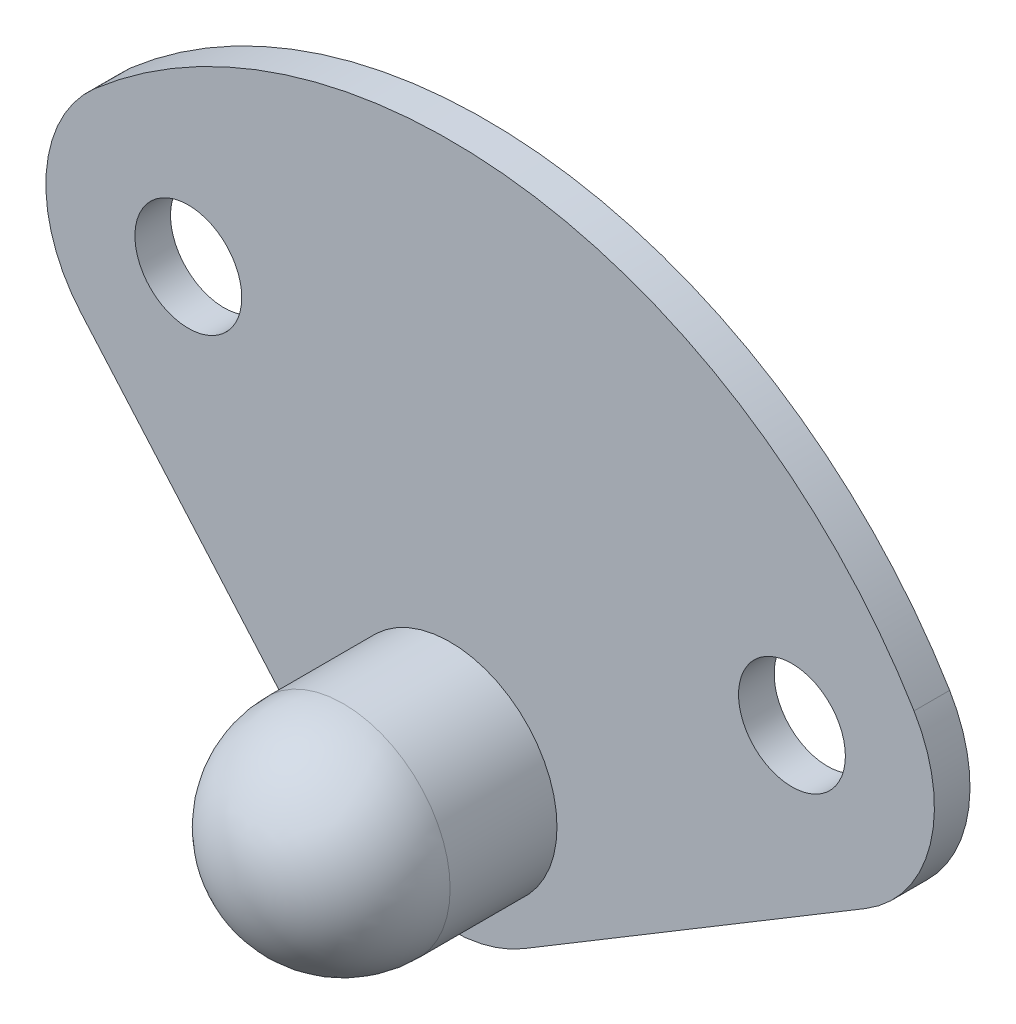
ISO-10303-21;
HEADER;
FILE_DESCRIPTION(('STEP AP214'),'2;1');
FILE_NAME('part.step','',(''),(''),'','','');
FILE_SCHEMA(('AUTOMOTIVE_DESIGN { 1 0 10303 214 1 1 1 1 }'));
ENDSEC;
DATA;
#1=APPLICATION_CONTEXT('core data for automotive mechanical design processes');
#2=APPLICATION_PROTOCOL_DEFINITION('international standard','automotive_design',2000,#1);
#3=PRODUCT_CONTEXT('',#1,'mechanical');
#4=PRODUCT('Part','Part','',(#3));
#5=PRODUCT_RELATED_PRODUCT_CATEGORY('part','',(#4));
#6=PRODUCT_DEFINITION_FORMATION('','',#4);
#7=PRODUCT_DEFINITION_CONTEXT('part definition',#1,'design');
#8=PRODUCT_DEFINITION('design','',#6,#7);
#9=PRODUCT_DEFINITION_SHAPE('','',#8);
#10=(LENGTH_UNIT() NAMED_UNIT(*) SI_UNIT(.MILLI.,.METRE.));
#11=(NAMED_UNIT(*) PLANE_ANGLE_UNIT() SI_UNIT($,.RADIAN.));
#12=(NAMED_UNIT(*) SI_UNIT($,.STERADIAN.) SOLID_ANGLE_UNIT());
#13=UNCERTAINTY_MEASURE_WITH_UNIT(LENGTH_MEASURE(1.E-05),#10,'distance_accuracy_value','');
#14=(GEOMETRIC_REPRESENTATION_CONTEXT(3) GLOBAL_UNCERTAINTY_ASSIGNED_CONTEXT((#13)) GLOBAL_UNIT_ASSIGNED_CONTEXT((#10,
#11,#12)) REPRESENTATION_CONTEXT('',''));
#15=CARTESIAN_POINT('',(0.,0.,0.));
#16=DIRECTION('',(0.,0.,1.));
#17=DIRECTION('',(1.,0.,0.));
#18=AXIS2_PLACEMENT_3D('',#15,#16,#17);
#19=CARTESIAN_POINT('',(0.,0.,9.99999999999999));
#20=DIRECTION('',(0.,0.,-1.));
#21=DIRECTION('',(-1.,0.,0.));
#22=AXIS2_PLACEMENT_3D('',#19,#20,#21);
#23=PLANE('',#22);
#24=CARTESIAN_POINT('',(95.9763559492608,57.7281482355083,10.));
#25=DIRECTION('',(0.,0.,1.));
#26=DIRECTION('',(1.,0.,0.));
#27=AXIS2_PLACEMENT_3D('',#24,#25,#26);
#28=CIRCLE('',#27,15.);
#29=CARTESIAN_POINT('',(110.976355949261,57.7281482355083,10.));
#30=VERTEX_POINT('',#29);
#31=EDGE_CURVE('E218',#30,#30,#28,.T.);
#32=ORIENTED_EDGE('',*,*,#31,.F.);
#33=EDGE_LOOP('',(#32));
#34=FACE_BOUND('',#33,.T.);
#35=CARTESIAN_POINT('',(0.,0.,9.99999999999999));
#36=DIRECTION('',(0.,0.,1.));
#37=DIRECTION('',(-1.,0.,0.));
#38=AXIS2_PLACEMENT_3D('',#35,#36,#37);
#39=CIRCLE('',#38,40.);
#40=CARTESIAN_POINT('',(-30.1763827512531,-26.2561597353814,9.99999999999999));
#41=VERTEX_POINT('',#40);
#42=CARTESIAN_POINT('',(20.6171957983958,-34.2772699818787,9.99999999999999));
#43=VERTEX_POINT('',#42);
#44=EDGE_CURVE('E132',#41,#43,#39,.T.);
#45=ORIENTED_EDGE('',*,*,#44,.T.);
#46=DIRECTION('',(0.85693174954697,0.515429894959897,0.));
#47=VECTOR('',#46,1.);
#48=CARTESIAN_POINT('',(116.593551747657,23.4508782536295,9.99999999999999));
#49=LINE('',#48,#47);
#50=CARTESIAN_POINT('',(116.593551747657,23.4508782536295,9.99999999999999));
#51=VERTEX_POINT('',#50);
#52=EDGE_CURVE('E90',#43,#51,#49,.T.);
#53=ORIENTED_EDGE('',*,*,#52,.T.);
#54=CARTESIAN_POINT('',(95.9763559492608,57.7281482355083,10.));
#55=DIRECTION('',(0.,0.,1.));
#56=DIRECTION('',(-1.,0.,0.));
#57=AXIS2_PLACEMENT_3D('',#54,#55,#56);
#58=CIRCLE('',#57,39.9999999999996);
#59=CARTESIAN_POINT('',(130.253625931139,78.3453440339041,9.99999999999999));
#60=VERTEX_POINT('',#59);
#61=EDGE_CURVE('E103',#51,#60,#58,.T.);
#62=ORIENTED_EDGE('',*,*,#61,.T.);
#63=CARTESIAN_POINT('',(0.,0.,9.99999999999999));
#64=DIRECTION('',(0.,0.,1.));
#65=DIRECTION('',(1.,0.,0.));
#66=AXIS2_PLACEMENT_3D('',#63,#64,#65);
#67=CIRCLE('',#66,152.);
#68=CARTESIAN_POINT('',(-99.7734069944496,114.670254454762,10.));
#69=VERTEX_POINT('',#68);
#70=EDGE_CURVE('E97',#60,#69,#67,.T.);
#71=ORIENTED_EDGE('',*,*,#70,.T.);
#72=CARTESIAN_POINT('',(-73.5172472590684,84.4938717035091,9.99999999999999));
#73=DIRECTION('',(0.,0.,1.));
#74=DIRECTION('',(-1.,0.,0.));
#75=AXIS2_PLACEMENT_3D('',#72,#73,#74);
#76=CIRCLE('',#75,40.);
#77=CARTESIAN_POINT('',(-103.693630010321,58.2377119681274,9.99999999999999));
#78=VERTEX_POINT('',#77);
#79=EDGE_CURVE('E101',#69,#78,#76,.T.);
#80=ORIENTED_EDGE('',*,*,#79,.T.);
#81=DIRECTION('',(0.656403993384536,-0.754409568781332,0.));
#82=VECTOR('',#81,1.);
#83=CARTESIAN_POINT('',(-30.1763827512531,-26.2561597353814,9.99999999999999));
#84=LINE('',#83,#82);
#85=EDGE_CURVE('E53',#78,#41,#84,.T.);
#86=ORIENTED_EDGE('',*,*,#85,.T.);
#87=EDGE_LOOP('',(#45,#53,#62,#71,#80,#86));
#88=FACE_BOUND('',#87,.T.);
#89=CARTESIAN_POINT('',(0.,0.,9.99999999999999));
#90=DIRECTION('',(0.,0.,1.));
#91=DIRECTION('',(1.,0.,0.));
#92=AXIS2_PLACEMENT_3D('',#89,#90,#91);
#93=CIRCLE('',#92,30.);
#94=CARTESIAN_POINT('',(30.,0.,9.99999999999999));
#95=VERTEX_POINT('',#94);
#96=EDGE_CURVE('E125',#95,#95,#93,.T.);
#97=ORIENTED_EDGE('',*,*,#96,.F.);
#98=EDGE_LOOP('',(#97));
#99=FACE_BOUND('',#98,.T.);
#100=CARTESIAN_POINT('',(-73.5172472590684,84.4938717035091,9.99999999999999));
#101=DIRECTION('',(0.,0.,1.));
#102=DIRECTION('',(1.,0.,0.));
#103=AXIS2_PLACEMENT_3D('',#100,#101,#102);
#104=CIRCLE('',#103,15.);
#105=CARTESIAN_POINT('',(-58.5172472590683,84.4938717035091,9.99999999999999));
#106=VERTEX_POINT('',#105);
#107=EDGE_CURVE('E212',#106,#106,#104,.T.);
#108=ORIENTED_EDGE('',*,*,#107,.F.);
#109=EDGE_LOOP('',(#108));
#110=FACE_BOUND('',#109,.T.);
#111=ADVANCED_FACE('F36',(#34,#88,#99,#110),#23,.F.);
#112=CARTESIAN_POINT('',(0.,0.,0.));
#113=DIRECTION('',(0.,0.,-1.));
#114=DIRECTION('',(-1.,0.,0.));
#115=AXIS2_PLACEMENT_3D('',#112,#113,#114);
#116=PLANE('',#115);
#117=CARTESIAN_POINT('',(95.9763559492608,57.7281482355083,0.));
#118=DIRECTION('',(0.,0.,1.));
#119=DIRECTION('',(1.,0.,0.));
#120=AXIS2_PLACEMENT_3D('',#117,#118,#119);
#121=CIRCLE('',#120,15.);
#122=CARTESIAN_POINT('',(110.976355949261,57.7281482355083,0.));
#123=VERTEX_POINT('',#122);
#124=EDGE_CURVE('E215',#123,#123,#121,.T.);
#125=ORIENTED_EDGE('',*,*,#124,.T.);
#126=EDGE_LOOP('',(#125));
#127=FACE_BOUND('',#126,.T.);
#128=CARTESIAN_POINT('',(0.,0.,0.));
#129=DIRECTION('',(0.,0.,1.));
#130=DIRECTION('',(-1.,0.,0.));
#131=AXIS2_PLACEMENT_3D('',#128,#129,#130);
#132=CIRCLE('',#131,40.);
#133=CARTESIAN_POINT('',(-30.1763827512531,-26.2561597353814,0.));
#134=VERTEX_POINT('',#133);
#135=CARTESIAN_POINT('',(20.6171957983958,-34.2772699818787,0.));
#136=VERTEX_POINT('',#135);
#137=EDGE_CURVE('E121',#134,#136,#132,.T.);
#138=ORIENTED_EDGE('',*,*,#137,.F.);
#139=DIRECTION('',(0.656403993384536,-0.754409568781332,0.));
#140=VECTOR('',#139,1.);
#141=CARTESIAN_POINT('',(-30.1763827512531,-26.2561597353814,0.));
#142=LINE('',#141,#140);
#143=CARTESIAN_POINT('',(-103.693630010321,58.2377119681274,0.));
#144=VERTEX_POINT('',#143);
#145=EDGE_CURVE('E82',#144,#134,#142,.T.);
#146=ORIENTED_EDGE('',*,*,#145,.F.);
#147=CARTESIAN_POINT('',(-73.5172472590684,84.4938717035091,0.));
#148=DIRECTION('',(0.,0.,1.));
#149=DIRECTION('',(-1.,0.,0.));
#150=AXIS2_PLACEMENT_3D('',#147,#148,#149);
#151=CIRCLE('',#150,40.);
#152=CARTESIAN_POINT('',(-99.7734069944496,114.670254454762,0.));
#153=VERTEX_POINT('',#152);
#154=EDGE_CURVE('E76',#153,#144,#151,.T.);
#155=ORIENTED_EDGE('',*,*,#154,.F.);
#156=CARTESIAN_POINT('',(0.,0.,0.));
#157=DIRECTION('',(0.,0.,1.));
#158=DIRECTION('',(1.,0.,0.));
#159=AXIS2_PLACEMENT_3D('',#156,#157,#158);
#160=CIRCLE('',#159,152.);
#161=CARTESIAN_POINT('',(130.253625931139,78.3453440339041,0.));
#162=VERTEX_POINT('',#161);
#163=EDGE_CURVE('E111',#162,#153,#160,.T.);
#164=ORIENTED_EDGE('',*,*,#163,.F.);
#165=CARTESIAN_POINT('',(95.9763559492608,57.7281482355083,0.));
#166=DIRECTION('',(0.,0.,1.));
#167=DIRECTION('',(-1.,0.,0.));
#168=AXIS2_PLACEMENT_3D('',#165,#166,#167);
#169=CIRCLE('',#168,39.9999999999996);
#170=CARTESIAN_POINT('',(116.593551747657,23.4508782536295,0.));
#171=VERTEX_POINT('',#170);
#172=EDGE_CURVE('E127',#171,#162,#169,.T.);
#173=ORIENTED_EDGE('',*,*,#172,.F.);
#174=DIRECTION('',(0.85693174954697,0.515429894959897,0.));
#175=VECTOR('',#174,1.);
#176=CARTESIAN_POINT('',(116.593551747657,23.4508782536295,0.));
#177=LINE('',#176,#175);
#178=EDGE_CURVE('E124',#136,#171,#177,.T.);
#179=ORIENTED_EDGE('',*,*,#178,.F.);
#180=EDGE_LOOP('',(#138,#146,#155,#164,#173,#179));
#181=FACE_BOUND('',#180,.T.);
#182=CARTESIAN_POINT('',(0.,0.,0.));
#183=DIRECTION('',(0.,0.,-1.));
#184=DIRECTION('',(-1.,0.,0.));
#185=AXIS2_PLACEMENT_3D('',#182,#183,#184);
#186=CIRCLE('',#185,30.);
#187=CARTESIAN_POINT('',(-30.,0.,0.));
#188=VERTEX_POINT('',#187);
#189=EDGE_CURVE('E208',#188,#188,#186,.T.);
#190=ORIENTED_EDGE('',*,*,#189,.F.);
#191=EDGE_LOOP('',(#190));
#192=FACE_BOUND('',#191,.T.);
#193=CARTESIAN_POINT('',(-73.5172472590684,84.4938717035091,0.));
#194=DIRECTION('',(0.,0.,1.));
#195=DIRECTION('',(1.,0.,0.));
#196=AXIS2_PLACEMENT_3D('',#193,#194,#195);
#197=CIRCLE('',#196,15.);
#198=CARTESIAN_POINT('',(-58.5172472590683,84.4938717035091,0.));
#199=VERTEX_POINT('',#198);
#200=EDGE_CURVE('E211',#199,#199,#197,.T.);
#201=ORIENTED_EDGE('',*,*,#200,.T.);
#202=EDGE_LOOP('',(#201));
#203=FACE_BOUND('',#202,.T.);
#204=ADVANCED_FACE('F141',(#127,#181,#192,#203),#116,.T.);
#205=CARTESIAN_POINT('',(0.,0.,9.99999999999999));
#206=DIRECTION('',(0.,0.,-1.));
#207=DIRECTION('',(-1.,0.,0.));
#208=AXIS2_PLACEMENT_3D('',#205,#206,#207);
#209=CYLINDRICAL_SURFACE('',#208,40.);
#210=ORIENTED_EDGE('',*,*,#137,.T.);
#211=DIRECTION('',(0.,0.,-1.));
#212=VECTOR('',#211,1.);
#213=CARTESIAN_POINT('',(20.6171957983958,-34.2772699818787,9.99999999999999));
#214=LINE('',#213,#212);
#215=EDGE_CURVE('E11',#43,#136,#214,.T.);
#216=ORIENTED_EDGE('',*,*,#215,.F.);
#217=ORIENTED_EDGE('',*,*,#44,.F.);
#218=DIRECTION('',(0.,0.,-1.));
#219=VECTOR('',#218,1.);
#220=CARTESIAN_POINT('',(-30.1763827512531,-26.2561597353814,9.99999999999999));
#221=LINE('',#220,#219);
#222=EDGE_CURVE('E117',#41,#134,#221,.T.);
#223=ORIENTED_EDGE('',*,*,#222,.T.);
#224=EDGE_LOOP('',(#210,#216,#217,#223));
#225=FACE_BOUND('',#224,.T.);
#226=ADVANCED_FACE('F38',(#225),#209,.T.);
#227=CARTESIAN_POINT('',(116.593551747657,23.4508782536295,9.99999999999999));
#228=DIRECTION('',(-0.515429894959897,0.85693174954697,0.));
#229=DIRECTION('',(-0.85693174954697,-0.515429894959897,0.));
#230=AXIS2_PLACEMENT_3D('',#227,#228,#229);
#231=PLANE('',#230);
#232=ORIENTED_EDGE('',*,*,#178,.T.);
#233=DIRECTION('',(0.,0.,-1.));
#234=VECTOR('',#233,1.);
#235=CARTESIAN_POINT('',(116.593551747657,23.4508782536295,9.99999999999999));
#236=LINE('',#235,#234);
#237=EDGE_CURVE('E45',#51,#171,#236,.T.);
#238=ORIENTED_EDGE('',*,*,#237,.F.);
#239=ORIENTED_EDGE('',*,*,#52,.F.);
#240=ORIENTED_EDGE('',*,*,#215,.T.);
#241=EDGE_LOOP('',(#232,#238,#239,#240));
#242=FACE_BOUND('',#241,.T.);
#243=ADVANCED_FACE('F305',(#242),#231,.F.);
#244=CARTESIAN_POINT('',(95.9763559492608,57.7281482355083,10.));
#245=DIRECTION('',(0.,0.,-1.));
#246=DIRECTION('',(-1.,0.,0.));
#247=AXIS2_PLACEMENT_3D('',#244,#245,#246);
#248=CYLINDRICAL_SURFACE('',#247,39.9999999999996);
#249=ORIENTED_EDGE('',*,*,#172,.T.);
#250=DIRECTION('',(0.,0.,-1.));
#251=VECTOR('',#250,1.);
#252=CARTESIAN_POINT('',(130.253625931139,78.3453440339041,9.99999999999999));
#253=LINE('',#252,#251);
#254=EDGE_CURVE('E112',#60,#162,#253,.T.);
#255=ORIENTED_EDGE('',*,*,#254,.F.);
#256=ORIENTED_EDGE('',*,*,#61,.F.);
#257=ORIENTED_EDGE('',*,*,#237,.T.);
#258=EDGE_LOOP('',(#249,#255,#256,#257));
#259=FACE_BOUND('',#258,.T.);
#260=ADVANCED_FACE('F138',(#259),#248,.T.);
#261=CARTESIAN_POINT('',(0.,0.,9.99999999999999));
#262=DIRECTION('',(0.,0.,-1.));
#263=DIRECTION('',(-1.,0.,0.));
#264=AXIS2_PLACEMENT_3D('',#261,#262,#263);
#265=CYLINDRICAL_SURFACE('',#264,152.);
#266=ORIENTED_EDGE('',*,*,#163,.T.);
#267=DIRECTION('',(0.,0.,-1.));
#268=VECTOR('',#267,1.);
#269=CARTESIAN_POINT('',(-99.7734069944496,114.670254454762,10.));
#270=LINE('',#269,#268);
#271=EDGE_CURVE('E108',#69,#153,#270,.T.);
#272=ORIENTED_EDGE('',*,*,#271,.F.);
#273=ORIENTED_EDGE('',*,*,#70,.F.);
#274=ORIENTED_EDGE('',*,*,#254,.T.);
#275=EDGE_LOOP('',(#266,#272,#273,#274));
#276=FACE_BOUND('',#275,.T.);
#277=ADVANCED_FACE('F109',(#276),#265,.T.);
#278=CARTESIAN_POINT('',(-73.5172472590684,84.4938717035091,9.99999999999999));
#279=DIRECTION('',(0.,0.,-1.));
#280=DIRECTION('',(-1.,0.,0.));
#281=AXIS2_PLACEMENT_3D('',#278,#279,#280);
#282=CYLINDRICAL_SURFACE('',#281,40.);
#283=ORIENTED_EDGE('',*,*,#154,.T.);
#284=DIRECTION('',(0.,0.,-1.));
#285=VECTOR('',#284,1.);
#286=CARTESIAN_POINT('',(-103.693630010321,58.2377119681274,9.99999999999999));
#287=LINE('',#286,#285);
#288=EDGE_CURVE('E113',#78,#144,#287,.T.);
#289=ORIENTED_EDGE('',*,*,#288,.F.);
#290=ORIENTED_EDGE('',*,*,#79,.F.);
#291=ORIENTED_EDGE('',*,*,#271,.T.);
#292=EDGE_LOOP('',(#283,#289,#290,#291));
#293=FACE_BOUND('',#292,.T.);
#294=ADVANCED_FACE('F115',(#293),#282,.T.);
#295=CARTESIAN_POINT('',(-30.1763827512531,-26.2561597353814,9.99999999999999));
#296=DIRECTION('',(0.754409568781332,0.656403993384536,0.));
#297=DIRECTION('',(-0.656403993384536,0.754409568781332,0.));
#298=AXIS2_PLACEMENT_3D('',#295,#296,#297);
#299=PLANE('',#298);
#300=ORIENTED_EDGE('',*,*,#145,.T.);
#301=ORIENTED_EDGE('',*,*,#222,.F.);
#302=ORIENTED_EDGE('',*,*,#85,.F.);
#303=ORIENTED_EDGE('',*,*,#288,.T.);
#304=EDGE_LOOP('',(#300,#301,#302,#303));
#305=FACE_BOUND('',#304,.T.);
#306=ADVANCED_FACE('F146',(#305),#299,.F.);
#307=CARTESIAN_POINT('',(95.9763559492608,57.7281482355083,10.));
#308=DIRECTION('',(0.,0.,-1.));
#309=DIRECTION('',(-1.,0.,0.));
#310=AXIS2_PLACEMENT_3D('',#307,#308,#309);
#311=CYLINDRICAL_SURFACE('',#310,15.);
#312=ORIENTED_EDGE('',*,*,#31,.T.);
#313=EDGE_LOOP('',(#312));
#314=FACE_BOUND('',#313,.T.);
#315=ORIENTED_EDGE('',*,*,#124,.F.);
#316=EDGE_LOOP('',(#315));
#317=FACE_BOUND('',#316,.T.);
#318=ADVANCED_FACE('F148',(#314,#317),#311,.F.);
#319=CARTESIAN_POINT('',(-73.5172472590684,84.4938717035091,9.99999999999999));
#320=DIRECTION('',(0.,0.,-1.));
#321=DIRECTION('',(-1.,0.,0.));
#322=AXIS2_PLACEMENT_3D('',#319,#320,#321);
#323=CYLINDRICAL_SURFACE('',#322,15.);
#324=ORIENTED_EDGE('',*,*,#107,.T.);
#325=EDGE_LOOP('',(#324));
#326=FACE_BOUND('',#325,.T.);
#327=ORIENTED_EDGE('',*,*,#200,.F.);
#328=EDGE_LOOP('',(#327));
#329=FACE_BOUND('',#328,.T.);
#330=ADVANCED_FACE('F154',(#326,#329),#323,.F.);
#331=CARTESIAN_POINT('',(0.,0.,-30.));
#332=DIRECTION('',(0.,0.,1.));
#333=DIRECTION('',(1.,0.,0.));
#334=AXIS2_PLACEMENT_3D('',#331,#332,#333);
#335=CYLINDRICAL_SURFACE('',#334,30.);
#336=CARTESIAN_POINT('',(0.,0.,40.));
#337=DIRECTION('',(0.,0.,1.));
#338=DIRECTION('',(1.,0.,0.));
#339=AXIS2_PLACEMENT_3D('',#336,#337,#338);
#340=CIRCLE('',#339,30.);
#341=CARTESIAN_POINT('',(30.,0.,40.));
#342=VERTEX_POINT('',#341);
#343=EDGE_CURVE('E197',#342,#342,#340,.T.);
#344=ORIENTED_EDGE('',*,*,#343,.F.);
#345=EDGE_LOOP('',(#344));
#346=FACE_BOUND('',#345,.T.);
#347=ORIENTED_EDGE('',*,*,#96,.T.);
#348=EDGE_LOOP('',(#347));
#349=FACE_BOUND('',#348,.T.);
#350=ADVANCED_FACE('F170',(#346,#349),#335,.T.);
#351=ORIENTED_EDGE('',*,*,#189,.T.);
#352=EDGE_LOOP('',(#351));
#353=FACE_BOUND('',#352,.T.);
#354=CARTESIAN_POINT('',(0.,0.,-30.));
#355=DIRECTION('',(0.,0.,1.));
#356=DIRECTION('',(1.,0.,0.));
#357=AXIS2_PLACEMENT_3D('',#354,#355,#356);
#358=CIRCLE('',#357,30.);
#359=CARTESIAN_POINT('',(30.,0.,-30.));
#360=VERTEX_POINT('',#359);
#361=EDGE_CURVE('E205',#360,#360,#358,.T.);
#362=ORIENTED_EDGE('',*,*,#361,.T.);
#363=EDGE_LOOP('',(#362));
#364=FACE_BOUND('',#363,.T.);
#365=ADVANCED_FACE('F172',(#353,#364),#335,.T.);
#366=CARTESIAN_POINT('',(0.,0.,-30.));
#367=DIRECTION('',(0.,0.,1.));
#368=DIRECTION('',(1.,0.,0.));
#369=AXIS2_PLACEMENT_3D('',#366,#367,#368);
#370=PLANE('',#369);
#371=CARTESIAN_POINT('',(0.,0.,-30.));
#372=DIRECTION('',(0.,0.,1.));
#373=DIRECTION('',(1.,0.,0.));
#374=AXIS2_PLACEMENT_3D('',#371,#372,#373);
#375=CIRCLE('',#374,27.);
#376=CARTESIAN_POINT('',(27.,0.,-30.));
#377=VERTEX_POINT('',#376);
#378=EDGE_CURVE('E200',#377,#377,#375,.T.);
#379=ORIENTED_EDGE('',*,*,#378,.T.);
#380=EDGE_LOOP('',(#379));
#381=FACE_BOUND('',#380,.T.);
#382=ORIENTED_EDGE('',*,*,#361,.F.);
#383=EDGE_LOOP('',(#382));
#384=FACE_BOUND('',#383,.T.);
#385=ADVANCED_FACE('F175',(#381,#384),#370,.F.);
#386=CARTESIAN_POINT('',(0.,0.,-30.));
#387=DIRECTION('',(0.,0.,1.));
#388=DIRECTION('',(1.,0.,0.));
#389=AXIS2_PLACEMENT_3D('',#386,#387,#388);
#390=CYLINDRICAL_SURFACE('',#389,27.);
#391=ORIENTED_EDGE('',*,*,#378,.F.);
#392=EDGE_LOOP('',(#391));
#393=FACE_BOUND('',#392,.T.);
#394=CARTESIAN_POINT('',(0.,0.,40.));
#395=DIRECTION('',(0.,0.,-1.));
#396=DIRECTION('',(-1.,0.,0.));
#397=AXIS2_PLACEMENT_3D('',#394,#395,#396);
#398=CIRCLE('',#397,27.);
#399=CARTESIAN_POINT('',(-27.,0.,40.));
#400=VERTEX_POINT('',#399);
#401=EDGE_CURVE('E195',#400,#400,#398,.F.);
#402=ORIENTED_EDGE('',*,*,#401,.T.);
#403=EDGE_LOOP('',(#402));
#404=FACE_BOUND('',#403,.T.);
#405=ADVANCED_FACE('F179',(#393,#404),#390,.F.);
#406=CARTESIAN_POINT('',(0.,0.,40.));
#407=DIRECTION('',(0.,0.,-1.));
#408=DIRECTION('',(0.,1.,0.));
#409=AXIS2_PLACEMENT_3D('',#406,#407,#408);
#410=SPHERICAL_SURFACE('',#409,30.);
#411=ORIENTED_EDGE('',*,*,#343,.T.);
#412=EDGE_LOOP('',(#411));
#413=FACE_BOUND('',#412,.T.);
#414=ADVANCED_FACE('F183',(#413),#410,.T.);
#415=CARTESIAN_POINT('',(-2.22044604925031E-13,29.9999999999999,40.));
#416=DIRECTION('',(0.,0.,-1.));
#417=DIRECTION('',(-1.,0.,0.));
#418=AXIS2_PLACEMENT_3D('',#415,#416,#417);
#419=PLANE('',#418);
#420=ORIENTED_EDGE('',*,*,#401,.F.);
#421=EDGE_LOOP('',(#420));
#422=FACE_BOUND('',#421,.T.);
#423=ADVANCED_FACE('F187',(#422),#419,.T.);
#424=CLOSED_SHELL('',(#111,#204,#226,#243,#260,#277,#294,#306,#318,#330,#350,#365,#385,#405,
#414,#423));
#425=MANIFOLD_SOLID_BREP('B2',#424);
#426=ADVANCED_BREP_SHAPE_REPRESENTATION('',(#18,#425),#14);
#427=SHAPE_DEFINITION_REPRESENTATION(#9,#426);
ENDSEC;
END-ISO-10303-21;
